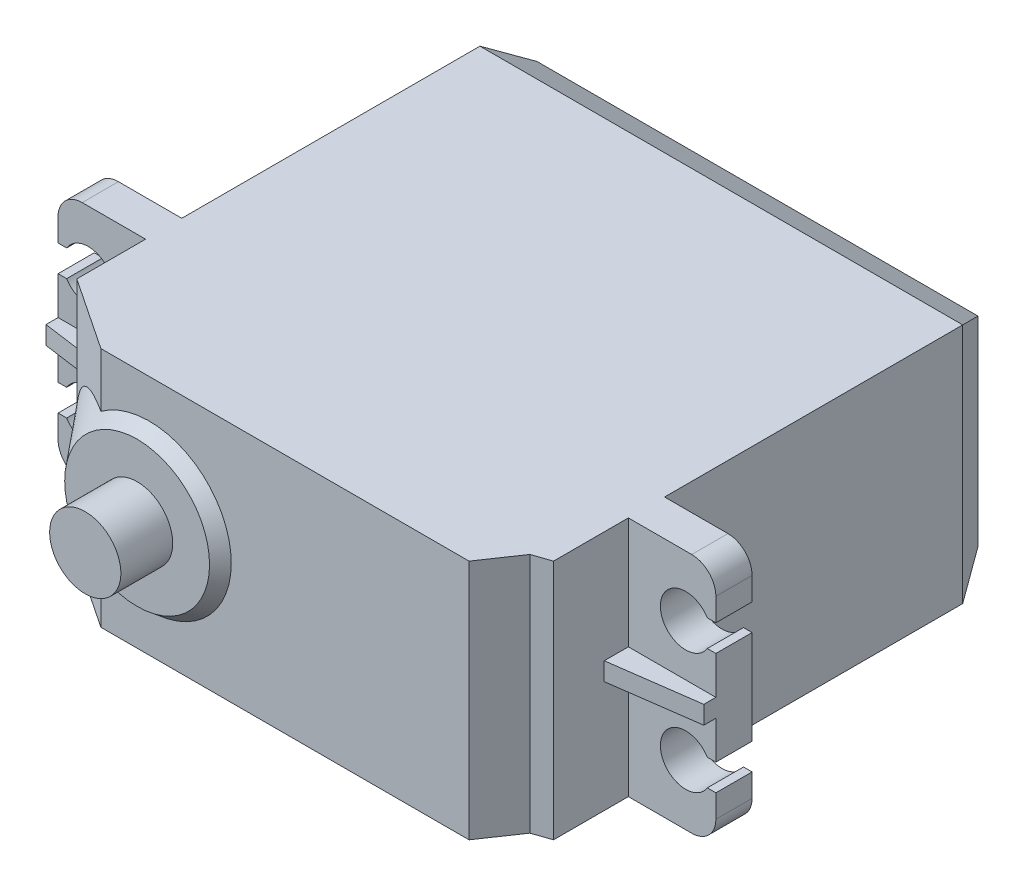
from build123d import *
from OCP.BRepFilletAPI import BRepFilletAPI_MakeChamfer

# Parameters (mm, degrees)
ESQUISSE1_W             = 40
ESQUISSE1_H             = 20
BOSS_EXTRU_1_DEPTH      = 40.4
BOSS_EXTRU_2_DEPTH      = 3
CONG_1_R                = 2
BOSS_EXTRU_3_DEPTH      = 0.75
BOSS_EXTRU_3_DEPTH_BACK = 0.75
CHANFREIN1_SIZE         = 3
CHANFREIN1_SIZE2        = 1.732050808
CHANFREIN2_SIZE         = 4
CHANFREIN2_SIZE2        = 6
ENL_V_MAT_EXTRU_1_DEPTH = 53.675634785
ESQUISSE6_R             = 2.95
BOSS_EXTRU_4_DEPTH      = 4.3


with BuildPart() as part:
    # Esquisse1 → Boss.-Extru.1 (new body)
    with BuildSketch(Plane.XY):
        Rectangle(ESQUISSE1_W, ESQUISSE1_H)
    extrude(amount=BOSS_EXTRU_1_DEPTH)

    # Esquisse2 → Boss.-Extru.2 (add)
    with BuildSketch(Plane(origin=(0, 0, 27.7), x_dir=(-1, 0, 0), z_dir=(0, 0, -1))):
        with BuildLine():
            Line((-20, 10), (-27.25, 10))
            Line((-27.25, 10), (-27.25, 6.1))
            Line((-27.25, 6.1), (-26.538854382, 6.1))
            ThreePointArc((-26.538854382, 6.1), (-22.65, 5), (-26.538854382, 3.9))
            Line((-26.538854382, 3.9), (-27.25, 3.9))
            Line((-27.25, 3.9), (-27.25, -3.9))
            Line((-27.25, -3.9), (-26.538854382, -3.9))
            ThreePointArc((-26.538854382, -3.9), (-22.65, -5), (-26.538854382, -6.1))
            Line((-26.538854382, -6.1), (-27.25, -6.1))
            Line((-27.25, -6.1), (-27.25, -10))
            Line((-27.25, -10), (-20, -10))
            Line((-20, -10), (-20, 10))
        make_face()
        with BuildLine():
            Line((20, -10), (27.25, -10))
            Line((27.25, -10), (27.25, -6.1))
            Line((27.25, -6.1), (26.538854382, -6.1))
            ThreePointArc((26.538854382, -6.1), (22.65, -5), (26.538854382, -3.9))
            Line((26.538854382, -3.9), (27.25, -3.9))
            Line((27.25, -3.9), (27.25, 3.9))
            Line((27.25, 3.9), (26.538854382, 3.9))
            ThreePointArc((26.538854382, 3.9), (22.65, 5), (26.538854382, 6.1))
            Line((26.538854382, 6.1), (27.25, 6.1))
            Line((27.25, 6.1), (27.25, 10))
            Line((27.25, 10), (20, 10))
            Line((20, 10), (20, -10))
        make_face()
    extrude(amount=-BOSS_EXTRU_2_DEPTH)

    # Cong_1
    cong_1_edges = [part.edges().sort_by_distance(p)[0] for p in [
        (-27.25, 10, 29.2),
        (27.25, 10, 29.2),
        (-27.25, -10, 29.2),
        (27.25, -10, 29.2),
    ]]
    fillet(cong_1_edges, radius=CONG_1_R)

    # Esquisse3 → Boss.-Extru.3 (add, two sides: drawn at the far end of the back side and taken through both)
    with BuildSketch(Plane(origin=(0, 0, 0), x_dir=(1, 0, 0), z_dir=(0, 1, 0)).offset(-BOSS_EXTRU_3_DEPTH_BACK)):
        Polygon((-27.25, -30.7), (-27.25, -31.7), (-20, -32.7), (-20, -30.7), align=None)
        Polygon((27.25, -31.7), (20, -32.7), (20, -30.7), (27.25, -30.7), align=None)
    extrude(amount=BOSS_EXTRU_3_DEPTH + BOSS_EXTRU_3_DEPTH_BACK)

    # Chanfrein1: one chamfer whose edges measure the first distance from different faces: ONE call of the kernel's chamfer builder (chamfer() names one face for all edges)
    chanfrein1_edges_1 = [part.edges().sort_by_distance(p)[0] for p in [
        (0, 10, 0),
    ]]
    chanfrein1_side_1 = [part.faces().sort_by_distance(p)[0] for p in [
        (0, 10, 20.372078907),
    ]]
    chanfrein1_edges_2 = [part.edges().sort_by_distance(p)[0] for p in [
        (20, 0, 0),
    ]]
    chanfrein1_side_2 = [part.faces().sort_by_distance(p)[0] for p in [
        (20, 0, 13.85),
    ]]
    chanfrein1_edges_3 = [part.edges().sort_by_distance(p)[0] for p in [
        (0, -10, 0),
    ]]
    chanfrein1_side_3 = [part.faces().sort_by_distance(p)[0] for p in [
        (0, -10, 20.372078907),
    ]]
    chanfrein1_edges_4 = [part.edges().sort_by_distance(p)[0] for p in [
        (-20, 0, 0),
    ]]
    chanfrein1_side_4 = [part.faces().sort_by_distance(p)[0] for p in [
        (-20, 0, 13.85),
    ]]
    chanfrein1 = BRepFilletAPI_MakeChamfer(part.part.solid().wrapped)
    for e in chanfrein1_edges_1:
        chanfrein1.Add(CHANFREIN1_SIZE, CHANFREIN1_SIZE2, e.wrapped, chanfrein1_side_1[0].wrapped)  # the first distance lies on this face
    for e in chanfrein1_edges_2:
        chanfrein1.Add(CHANFREIN1_SIZE, CHANFREIN1_SIZE2, e.wrapped, chanfrein1_side_2[0].wrapped)  # the first distance lies on this face
    for e in chanfrein1_edges_3:
        chanfrein1.Add(CHANFREIN1_SIZE, CHANFREIN1_SIZE2, e.wrapped, chanfrein1_side_3[0].wrapped)  # the first distance lies on this face
    for e in chanfrein1_edges_4:
        chanfrein1.Add(CHANFREIN1_SIZE, CHANFREIN1_SIZE2, e.wrapped, chanfrein1_side_4[0].wrapped)  # the first distance lies on this face
    add(Compound.cast(chanfrein1.Shape()), mode=Mode.REPLACE)

    # Chanfrein2
    chanfrein2_edges = [part.edges().sort_by_distance(p)[0] for p in [
        (-20, 0, 40.4),
    ]]
    chanfrein2_side = [part.faces().sort_by_distance(p)[0] for p in [
        (-20, 0, 35.610471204),
    ]]
    chamfer(chanfrein2_edges, length=CHANFREIN2_SIZE, length2=CHANFREIN2_SIZE2, reference=chanfrein2_side[0])

    # Esquisse4 → Enl_v. mat.-Extru.1 (cut, through all)
    with BuildSketch(Plane.XZ.offset(10)):
        Polygon((16.5, 40.4), (18.539986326, 37.4), (20, 36.9), (20, 40.4), align=None)
    extrude(amount=-ENL_V_MAT_EXTRU_1_DEPTH, mode=Mode.SUBTRACT)

    # Esquisse5 → R_volution1 (revolve)
    with BuildSketch(Plane(origin=(0, 0, 0), x_dir=(1, 0, 0), z_dir=(0, 1, 0))):
        Polygon((-10, -41.4), (-16, -41.4), (-20, -36.4), (-10, -36.4), align=None)
    revolve(axis=Axis((-10, 0, 41.630007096), (0, 0, -1)))

    # Esquisse6 → Boss.-Extru.4 (add)
    with BuildSketch(Plane.XY.offset(41.4)):
        with Locations(Location((-10, 0, 0), (0, 0, 180))):
            Circle(ESQUISSE6_R)
    extrude(amount=BOSS_EXTRU_4_DEPTH)


solid = part.part
